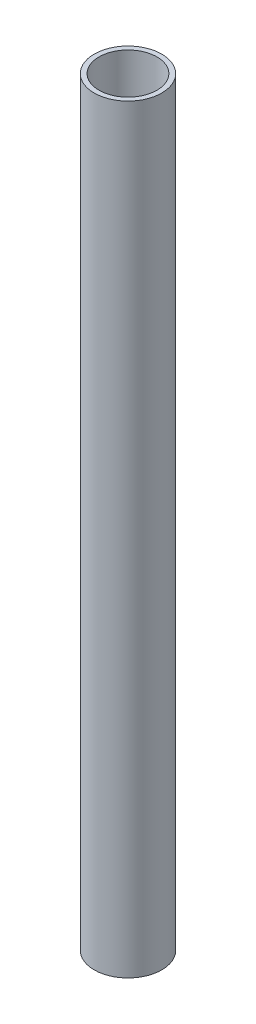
from build123d import *

# Parameters (mm, degrees)
CROQUIS2_R              = 22.225
CROQUIS2_R_2            = 19.05
SALIENTE_EXTRUIR1_DEPTH = 500


with BuildPart() as part:
    # Croquis2 → Saliente-Extruir1 (new body)
    with BuildSketch(Plane(origin=(0, 0, 0), x_dir=(1, 0, 0), z_dir=(0, 1, 0))):
        with Locations(Location((0, 0, 0), (0, 0, 270))):
            Circle(CROQUIS2_R)
        with Locations(Location((0, 0, 0), (0, 0, 270))):
            Circle(CROQUIS2_R_2, mode=Mode.SUBTRACT)
    extrude(amount=SALIENTE_EXTRUIR1_DEPTH)


solid = part.part
